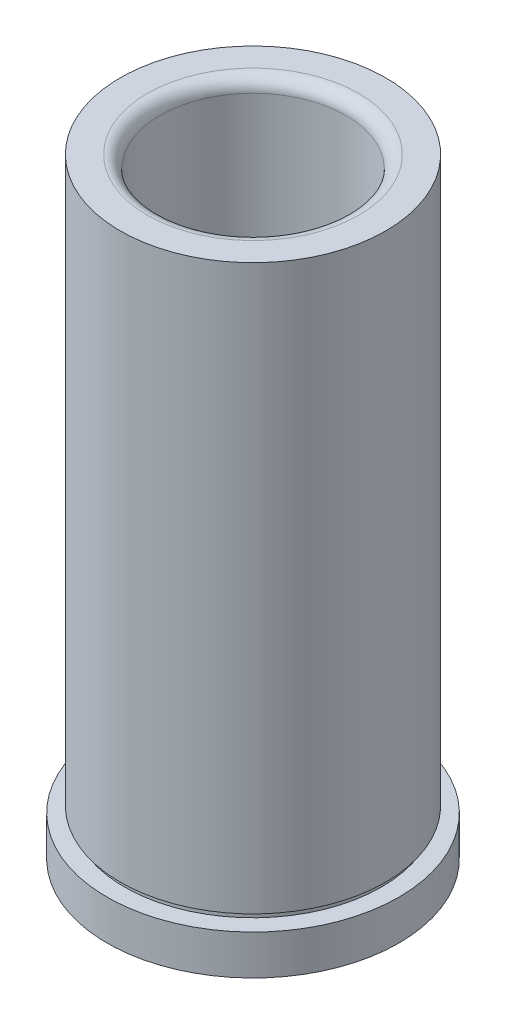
from build123d import *

# Parameters (mm, degrees)
FILLET1_R = 1.524


with BuildPart() as part:
    # Sketch1 → Revolve1 (revolve)
    with BuildSketch(Plane.XY, mode=Mode.PRIVATE) as revolve1_sk:
        with BuildLine():
            Line((-11.11885, 73.025), (-11.11885, 28.575))
            ThreePointArc((-11.11885, 28.575), (-12.016875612, 28.203025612), (-12.38885, 27.305))
            Line((-12.38885, 27.305), (-12.38885, 0.79375))
            Line((-12.38885, 0.79375), (-13.1826, 0))
            Line((-13.1826, 0), (-17.4625, 0))
            Line((-17.4625, 0), (-17.4625, 4.7625))
            Line((-17.4625, 4.7625), (-15.37335, 4.7625))
            Line((-15.37335, 4.7625), (-15.37335, 5.5245))
            Line((-15.37335, 5.5245), (-15.88135, 5.5245))
            Line((-15.88135, 5.5245), (-15.88135, 73.025))
            Line((-15.88135, 73.025), (-11.11885, 73.025))
        make_face()
    revolve(revolve1_sk.sketch.rotate(Axis((0, -1000, 0), (0, 1, 0)), 180), axis=Axis((0, -1000, 0), (0, 1, 0)))

    # Fillet1
    fillet1_edges = [part.edges().sort_by_distance(p)[0] for p in [
        (-11.11885, 73.025, 0),
    ]]
    fillet(fillet1_edges, radius=FILLET1_R)


solid = part.part
